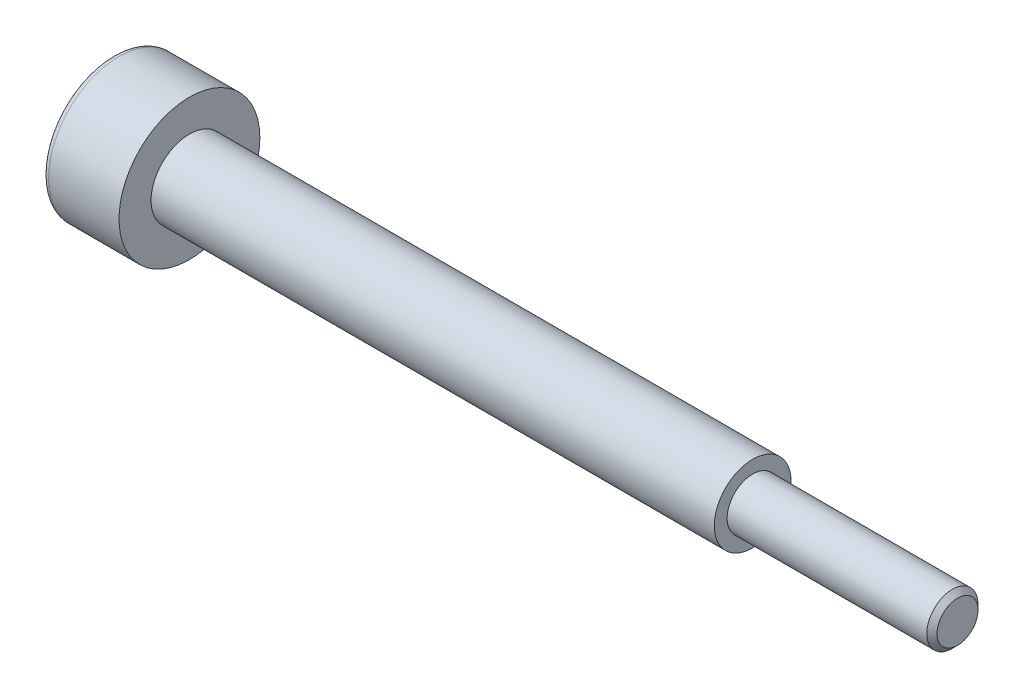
from build123d import *

# Parameters (mm, degrees)
CHANFREIN_TIGE_SIZE     = 0.25
CONG_TETE_R             = 0.25
ENL_V_MAT_EXTRU_1_DEPTH = 1.7
ESQUISSE4_W             = 8
ESQUISSE4_H             = 0.5
CHANFREIN1_SIZE         = 0.2


with BuildPart() as part:
    # Esquisse1 → Base-R_volution (revolve)
    with BuildSketch(Plane.XY, mode=Mode.PRIVATE) as base_r_volution_sk:
        Polygon((0, 1.5), (0, 2.75), (-3, 2.75), (-3, 0), (30, 0), (30, 1.5), align=None)
    revolve(base_r_volution_sk.sketch.rotate(Axis((12.501307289, 0, 0), (-1, 0, 0)), 90), axis=Axis((12.501307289, 0, 0), (-1, 0, 0)))

    # Chanfrein tige
    chanfrein_tige_edges = [part.edges().sort_by_distance(p)[0] for p in [
        (30, 0, 1.5),
    ]]
    chamfer(chanfrein_tige_edges, length=CHANFREIN_TIGE_SIZE)

    # Cong_ tete
    cong_tete_edges = [part.edges().sort_by_distance(p)[0] for p in [
        (-3, 0, 2.75),
    ]]
    fillet(cong_tete_edges, radius=CONG_TETE_R)

    # Esquisse2 → Enl_v. mat.-Extru.1 (cut)
    with BuildSketch(Plane.ZY.offset(3)):
        Polygon((1.443375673, 0), (0.721687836, 1.25), (-0.721687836, 1.25), (-1.443375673, 0), (-0.721687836, -1.25), (0.721687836, -1.25), align=None)
    extrude(amount=-ENL_V_MAT_EXTRU_1_DEPTH, mode=Mode.SUBTRACT)

    # Esquisse4 → Enl_vement de mati_re-R_volution1 (revolve, cut)
    with BuildSketch(Plane.XY, mode=Mode.PRIVATE) as enl_vement_de_mati_re_r_volution1_sk:
        with Locations((26, 1.25)):
            Rectangle(ESQUISSE4_W, ESQUISSE4_H)
    revolve(enl_vement_de_mati_re_r_volution1_sk.sketch.rotate(Axis((0, 0, 0), (1, 0, 0)), 90), axis=Axis((0, 0, 0), (1, 0, 0)), mode=Mode.SUBTRACT)

    # Chanfrein1
    chanfrein1_edges = [part.edges().sort_by_distance(p)[0] for p in [
        (30, 0, -1),
    ]]
    chamfer(chanfrein1_edges, length=CHANFREIN1_SIZE)


solid = part.part
